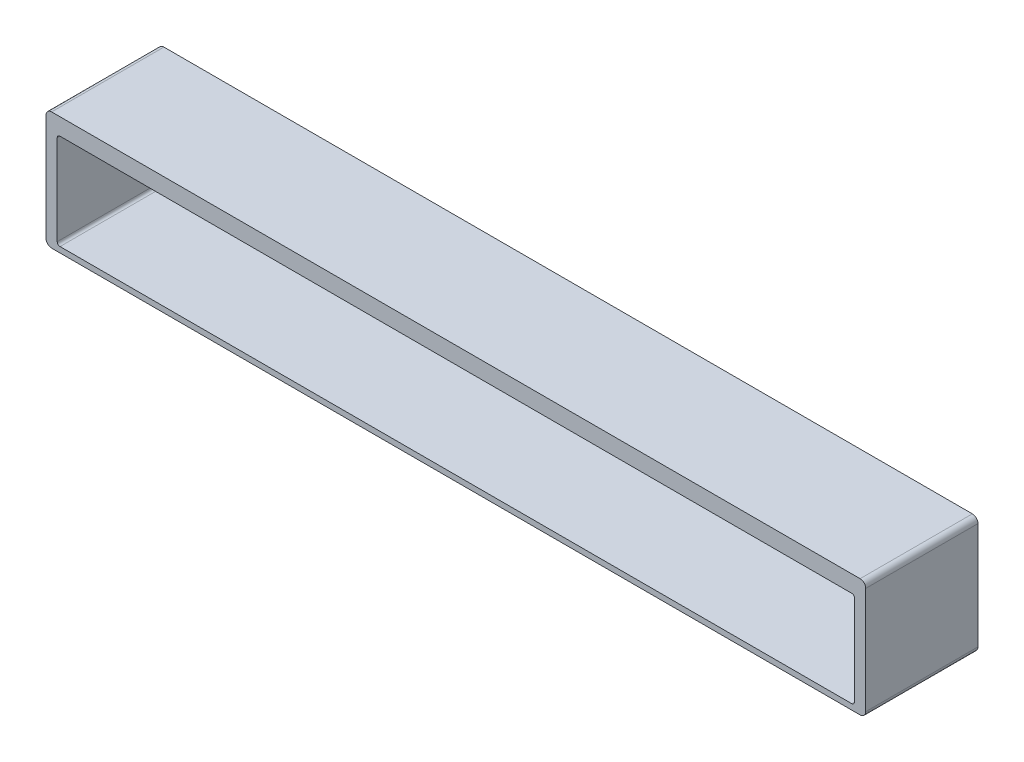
ISO-10303-21;
HEADER;
FILE_DESCRIPTION(('STEP AP214'),'2;1');
FILE_NAME('part.step','',(''),(''),'','','');
FILE_SCHEMA(('AUTOMOTIVE_DESIGN { 1 0 10303 214 1 1 1 1 }'));
ENDSEC;
DATA;
#1=APPLICATION_CONTEXT('core data for automotive mechanical design processes');
#2=APPLICATION_PROTOCOL_DEFINITION('international standard','automotive_design',2000,#1);
#3=PRODUCT_CONTEXT('',#1,'mechanical');
#4=PRODUCT('Part','Part','',(#3));
#5=PRODUCT_RELATED_PRODUCT_CATEGORY('part','',(#4));
#6=PRODUCT_DEFINITION_FORMATION('','',#4);
#7=PRODUCT_DEFINITION_CONTEXT('part definition',#1,'design');
#8=PRODUCT_DEFINITION('design','',#6,#7);
#9=PRODUCT_DEFINITION_SHAPE('','',#8);
#10=(LENGTH_UNIT() NAMED_UNIT(*) SI_UNIT(.MILLI.,.METRE.));
#11=(NAMED_UNIT(*) PLANE_ANGLE_UNIT() SI_UNIT($,.RADIAN.));
#12=(NAMED_UNIT(*) SI_UNIT($,.STERADIAN.) SOLID_ANGLE_UNIT());
#13=UNCERTAINTY_MEASURE_WITH_UNIT(LENGTH_MEASURE(1.E-05),#10,'distance_accuracy_value','');
#14=(GEOMETRIC_REPRESENTATION_CONTEXT(3) GLOBAL_UNCERTAINTY_ASSIGNED_CONTEXT((#13)) GLOBAL_UNIT_ASSIGNED_CONTEXT((#10,
#11,#12)) REPRESENTATION_CONTEXT('',''));
#15=CARTESIAN_POINT('',(0.,0.,0.));
#16=DIRECTION('',(0.,0.,1.));
#17=DIRECTION('',(1.,0.,0.));
#18=AXIS2_PLACEMENT_3D('',#15,#16,#17);
#19=CARTESIAN_POINT('',(-88.2099650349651,-6.1076923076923,-166.016788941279));
#20=DIRECTION('',(0.,1.,0.));
#21=DIRECTION('',(0.,0.,1.));
#22=AXIS2_PLACEMENT_3D('',#19,#20,#21);
#23=PLANE('',#22);
#24=DIRECTION('',(-1.,0.,0.));
#25=VECTOR('',#24,1.);
#26=CARTESIAN_POINT('',(-88.2099650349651,-6.1076923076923,-90.));
#27=LINE('',#26,#25);
#28=CARTESIAN_POINT('',(-18.7099650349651,-6.1076923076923,-90.));
#29=VERTEX_POINT('',#28);
#30=CARTESIAN_POINT('',(-90.7099650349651,-6.1076923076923,-90.));
#31=VERTEX_POINT('',#30);
#32=EDGE_CURVE('E260',#29,#31,#27,.T.);
#33=ORIENTED_EDGE('',*,*,#32,.F.);
#34=DIRECTION('',(0.,0.,-1.));
#35=VECTOR('',#34,1.);
#36=CARTESIAN_POINT('',(-18.7099650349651,-6.1076923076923,-166.016788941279));
#37=LINE('',#36,#35);
#38=CARTESIAN_POINT('',(-18.7099650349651,-6.1076923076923,-100.));
#39=VERTEX_POINT('',#38);
#40=EDGE_CURVE('E246',#29,#39,#37,.T.);
#41=ORIENTED_EDGE('',*,*,#40,.T.);
#42=DIRECTION('',(1.,0.,0.));
#43=VECTOR('',#42,1.);
#44=CARTESIAN_POINT('',(-98.7668120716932,-6.1076923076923,-100.));
#45=LINE('',#44,#43);
#46=CARTESIAN_POINT('',(-90.7099650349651,-6.1076923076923,-100.));
#47=VERTEX_POINT('',#46);
#48=EDGE_CURVE('E190',#47,#39,#45,.T.);
#49=ORIENTED_EDGE('',*,*,#48,.F.);
#50=DIRECTION('',(0.,0.,1.));
#51=VECTOR('',#50,1.);
#52=CARTESIAN_POINT('',(-90.7099650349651,-6.1076923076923,-166.016788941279));
#53=LINE('',#52,#51);
#54=EDGE_CURVE('E243',#47,#31,#53,.T.);
#55=ORIENTED_EDGE('',*,*,#54,.T.);
#56=EDGE_LOOP('',(#33,#41,#49,#55));
#57=FACE_BOUND('',#56,.T.);
#58=ADVANCED_FACE('F30',(#57),#23,.T.);
#59=CARTESIAN_POINT('',(-98.7668120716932,-16.6170699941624,-99.));
#60=DIRECTION('',(0.,-1.,0.));
#61=DIRECTION('',(0.,0.,-1.));
#62=AXIS2_PLACEMENT_3D('',#59,#60,#61);
#63=PLANE('',#62);
#64=DIRECTION('',(1.,0.,0.));
#65=VECTOR('',#64,1.);
#66=CARTESIAN_POINT('',(-98.7668120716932,-16.6170699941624,-90.));
#67=LINE('',#66,#65);
#68=CARTESIAN_POINT('',(-90.7099650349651,-16.6170699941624,-90.));
#69=VERTEX_POINT('',#68);
#70=CARTESIAN_POINT('',(-18.7099650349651,-16.6170699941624,-90.));
#71=VERTEX_POINT('',#70);
#72=EDGE_CURVE('E265',#69,#71,#67,.T.);
#73=ORIENTED_EDGE('',*,*,#72,.F.);
#74=DIRECTION('',(0.,0.,1.));
#75=VECTOR('',#74,1.);
#76=CARTESIAN_POINT('',(-90.7099650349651,-16.6170699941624,-99.));
#77=LINE('',#76,#75);
#78=CARTESIAN_POINT('',(-90.7099650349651,-16.6170699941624,-100.));
#79=VERTEX_POINT('',#78);
#80=EDGE_CURVE('E235',#69,#79,#77,.F.);
#81=ORIENTED_EDGE('',*,*,#80,.T.);
#82=DIRECTION('',(1.,0.,0.));
#83=VECTOR('',#82,1.);
#84=CARTESIAN_POINT('',(-98.7668120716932,-16.6170699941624,-100.));
#85=LINE('',#84,#83);
#86=CARTESIAN_POINT('',(-18.7099650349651,-16.6170699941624,-100.));
#87=VERTEX_POINT('',#86);
#88=EDGE_CURVE('E181',#79,#87,#85,.T.);
#89=ORIENTED_EDGE('',*,*,#88,.T.);
#90=DIRECTION('',(0.,0.,-1.));
#91=VECTOR('',#90,1.);
#92=CARTESIAN_POINT('',(-18.7099650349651,-16.6170699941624,-99.));
#93=LINE('',#92,#91);
#94=EDGE_CURVE('E233',#87,#71,#93,.F.);
#95=ORIENTED_EDGE('',*,*,#94,.T.);
#96=EDGE_LOOP('',(#73,#81,#89,#95));
#97=FACE_BOUND('',#96,.T.);
#98=ADVANCED_FACE('F297',(#97),#63,.T.);
#99=CARTESIAN_POINT('',(-98.7668120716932,-6.1076923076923,-100.));
#100=DIRECTION('',(0.,0.,-1.));
#101=DIRECTION('',(-1.,0.,0.));
#102=AXIS2_PLACEMENT_3D('',#99,#100,#101);
#103=PLANE('',#102);
#104=ORIENTED_EDGE('',*,*,#88,.F.);
#105=CARTESIAN_POINT('',(-90.7099650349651,-16.1170699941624,-100.));
#106=DIRECTION('',(0.,0.,-1.));
#107=DIRECTION('',(-1.,0.,0.));
#108=AXIS2_PLACEMENT_3D('',#105,#106,#107);
#109=CIRCLE('',#108,0.5);
#110=CARTESIAN_POINT('',(-91.2099650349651,-16.1170699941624,-100.));
#111=VERTEX_POINT('',#110);
#112=EDGE_CURVE('E241',#79,#111,#109,.T.);
#113=ORIENTED_EDGE('',*,*,#112,.T.);
#114=DIRECTION('',(0.,1.,0.));
#115=VECTOR('',#114,1.);
#116=CARTESIAN_POINT('',(-91.2099650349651,-104.00394301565,-100.));
#117=LINE('',#116,#115);
#118=CARTESIAN_POINT('',(-91.2099650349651,-6.6076923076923,-100.));
#119=VERTEX_POINT('',#118);
#120=EDGE_CURVE('E188',#111,#119,#117,.T.);
#121=ORIENTED_EDGE('',*,*,#120,.T.);
#122=CARTESIAN_POINT('',(-90.7099650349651,-6.6076923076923,-100.));
#123=DIRECTION('',(0.,0.,-1.));
#124=DIRECTION('',(-1.,0.,0.));
#125=AXIS2_PLACEMENT_3D('',#122,#123,#124);
#126=CIRCLE('',#125,0.5);
#127=EDGE_CURVE('E238',#119,#47,#126,.T.);
#128=ORIENTED_EDGE('',*,*,#127,.T.);
#129=ORIENTED_EDGE('',*,*,#48,.T.);
#130=CARTESIAN_POINT('',(-18.7099650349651,-6.6076923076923,-100.));
#131=DIRECTION('',(0.,0.,-1.));
#132=DIRECTION('',(-1.,0.,0.));
#133=AXIS2_PLACEMENT_3D('',#130,#131,#132);
#134=CIRCLE('',#133,0.5);
#135=CARTESIAN_POINT('',(-18.2099650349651,-6.6076923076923,-100.));
#136=VERTEX_POINT('',#135);
#137=EDGE_CURVE('E45',#39,#136,#134,.T.);
#138=ORIENTED_EDGE('',*,*,#137,.T.);
#139=DIRECTION('',(0.,1.,0.));
#140=VECTOR('',#139,1.);
#141=CARTESIAN_POINT('',(-18.2099650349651,-104.00394301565,-100.));
#142=LINE('',#141,#140);
#143=CARTESIAN_POINT('',(-18.2099650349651,-16.1170699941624,-100.));
#144=VERTEX_POINT('',#143);
#145=EDGE_CURVE('E251',#144,#136,#142,.T.);
#146=ORIENTED_EDGE('',*,*,#145,.F.);
#147=CARTESIAN_POINT('',(-18.7099650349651,-16.1170699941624,-100.));
#148=DIRECTION('',(0.,0.,-1.));
#149=DIRECTION('',(-1.,0.,0.));
#150=AXIS2_PLACEMENT_3D('',#147,#148,#149);
#151=CIRCLE('',#150,0.5);
#152=EDGE_CURVE('E53',#144,#87,#151,.T.);
#153=ORIENTED_EDGE('',*,*,#152,.T.);
#154=EDGE_LOOP('',(#104,#113,#121,#128,#129,#138,#146,#153));
#155=FACE_BOUND('',#154,.T.);
#156=ADVANCED_FACE('F257',(#155),#103,.T.);
#157=CARTESIAN_POINT('',(-91.2099650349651,-104.00394301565,-12.6188488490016));
#158=DIRECTION('',(-1.,0.,0.));
#159=DIRECTION('',(0.,0.,1.));
#160=AXIS2_PLACEMENT_3D('',#157,#158,#159);
#161=PLANE('',#160);
#162=ORIENTED_EDGE('',*,*,#120,.F.);
#163=DIRECTION('',(0.,0.,1.));
#164=VECTOR('',#163,1.);
#165=CARTESIAN_POINT('',(-91.2099650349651,-16.1170699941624,-12.6188488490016));
#166=LINE('',#165,#164);
#167=CARTESIAN_POINT('',(-91.2099650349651,-16.1170699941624,-90.));
#168=VERTEX_POINT('',#167);
#169=EDGE_CURVE('E222',#111,#168,#166,.T.);
#170=ORIENTED_EDGE('',*,*,#169,.T.);
#171=DIRECTION('',(0.,-1.,0.));
#172=VECTOR('',#171,1.);
#173=CARTESIAN_POINT('',(-91.2099650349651,-40.6709312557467,-90.));
#174=LINE('',#173,#172);
#175=CARTESIAN_POINT('',(-91.2099650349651,-6.6076923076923,-90.));
#176=VERTEX_POINT('',#175);
#177=EDGE_CURVE('E274',#176,#168,#174,.T.);
#178=ORIENTED_EDGE('',*,*,#177,.F.);
#179=DIRECTION('',(0.,0.,1.));
#180=VECTOR('',#179,1.);
#181=CARTESIAN_POINT('',(-91.2099650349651,-6.6076923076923,-12.6188488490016));
#182=LINE('',#181,#180);
#183=EDGE_CURVE('E220',#176,#119,#182,.F.);
#184=ORIENTED_EDGE('',*,*,#183,.T.);
#185=EDGE_LOOP('',(#162,#170,#178,#184));
#186=FACE_BOUND('',#185,.T.);
#187=ADVANCED_FACE('F283',(#186),#161,.T.);
#188=CARTESIAN_POINT('',(-18.2099650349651,-104.00394301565,-12.6188488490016));
#189=DIRECTION('',(1.,0.,0.));
#190=DIRECTION('',(0.,0.,-1.));
#191=AXIS2_PLACEMENT_3D('',#188,#189,#190);
#192=PLANE('',#191);
#193=ORIENTED_EDGE('',*,*,#145,.T.);
#194=DIRECTION('',(0.,0.,-1.));
#195=VECTOR('',#194,1.);
#196=CARTESIAN_POINT('',(-18.2099650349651,-6.6076923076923,-12.6188488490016));
#197=LINE('',#196,#195);
#198=CARTESIAN_POINT('',(-18.2099650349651,-6.6076923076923,-90.));
#199=VERTEX_POINT('',#198);
#200=EDGE_CURVE('E11',#136,#199,#197,.F.);
#201=ORIENTED_EDGE('',*,*,#200,.T.);
#202=DIRECTION('',(0.,-1.,0.));
#203=VECTOR('',#202,1.);
#204=CARTESIAN_POINT('',(-18.2099650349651,-40.6709312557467,-90.));
#205=LINE('',#204,#203);
#206=CARTESIAN_POINT('',(-18.2099650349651,-16.1170699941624,-90.));
#207=VERTEX_POINT('',#206);
#208=EDGE_CURVE('E254',#199,#207,#205,.T.);
#209=ORIENTED_EDGE('',*,*,#208,.T.);
#210=DIRECTION('',(0.,0.,-1.));
#211=VECTOR('',#210,1.);
#212=CARTESIAN_POINT('',(-18.2099650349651,-16.1170699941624,-12.6188488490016));
#213=LINE('',#212,#211);
#214=EDGE_CURVE('E38',#207,#144,#213,.T.);
#215=ORIENTED_EDGE('',*,*,#214,.T.);
#216=EDGE_LOOP('',(#193,#201,#209,#215));
#217=FACE_BOUND('',#216,.T.);
#218=ADVANCED_FACE('F250',(#217),#192,.T.);
#219=CARTESIAN_POINT('',(-18.2099650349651,-40.6709312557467,-90.));
#220=DIRECTION('',(0.,0.,-1.));
#221=DIRECTION('',(-1.,0.,0.));
#222=AXIS2_PLACEMENT_3D('',#219,#220,#221);
#223=PLANE('',#222);
#224=ORIENTED_EDGE('',*,*,#177,.T.);
#225=CARTESIAN_POINT('',(-90.7099650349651,-16.1170699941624,-90.));
#226=DIRECTION('',(0.,0.,-1.));
#227=DIRECTION('',(-1.,0.,0.));
#228=AXIS2_PLACEMENT_3D('',#225,#226,#227);
#229=CIRCLE('',#228,0.5);
#230=EDGE_CURVE('E231',#168,#69,#229,.F.);
#231=ORIENTED_EDGE('',*,*,#230,.T.);
#232=ORIENTED_EDGE('',*,*,#72,.T.);
#233=CARTESIAN_POINT('',(-18.7099650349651,-16.1170699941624,-90.));
#234=DIRECTION('',(0.,0.,-1.));
#235=DIRECTION('',(-1.,0.,0.));
#236=AXIS2_PLACEMENT_3D('',#233,#234,#235);
#237=CIRCLE('',#236,0.5);
#238=EDGE_CURVE('E225',#71,#207,#237,.F.);
#239=ORIENTED_EDGE('',*,*,#238,.T.);
#240=ORIENTED_EDGE('',*,*,#208,.F.);
#241=CARTESIAN_POINT('',(-18.7099650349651,-6.6076923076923,-90.));
#242=DIRECTION('',(0.,0.,-1.));
#243=DIRECTION('',(-1.,0.,0.));
#244=AXIS2_PLACEMENT_3D('',#241,#242,#243);
#245=CIRCLE('',#244,0.5);
#246=EDGE_CURVE('E229',#199,#29,#245,.F.);
#247=ORIENTED_EDGE('',*,*,#246,.T.);
#248=ORIENTED_EDGE('',*,*,#32,.T.);
#249=CARTESIAN_POINT('',(-90.7099650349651,-6.6076923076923,-90.));
#250=DIRECTION('',(0.,0.,-1.));
#251=DIRECTION('',(-1.,0.,0.));
#252=AXIS2_PLACEMENT_3D('',#249,#250,#251);
#253=CIRCLE('',#252,0.5);
#254=EDGE_CURVE('E227',#31,#176,#253,.F.);
#255=ORIENTED_EDGE('',*,*,#254,.T.);
#256=EDGE_LOOP('',(#224,#231,#232,#239,#240,#247,#248,#255));
#257=FACE_BOUND('',#256,.T.);
#258=DIRECTION('',(0.,1.,0.));
#259=VECTOR('',#258,1.);
#260=CARTESIAN_POINT('',(-90.2099650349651,-104.00394301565,-90.));
#261=LINE('',#260,#259);
#262=CARTESIAN_POINT('',(-90.2099650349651,-15.8670699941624,-90.));
#263=VERTEX_POINT('',#262);
#264=CARTESIAN_POINT('',(-90.2099650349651,-7.8576923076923,-90.));
#265=VERTEX_POINT('',#264);
#266=EDGE_CURVE('E271',#263,#265,#261,.T.);
#267=ORIENTED_EDGE('',*,*,#266,.T.);
#268=CARTESIAN_POINT('',(-89.9599650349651,-7.8576923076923,-90.));
#269=DIRECTION('',(0.,0.,-1.));
#270=DIRECTION('',(-1.,0.,0.));
#271=AXIS2_PLACEMENT_3D('',#268,#269,#270);
#272=CIRCLE('',#271,0.25);
#273=CARTESIAN_POINT('',(-89.9599650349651,-7.60769230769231,-90.));
#274=VERTEX_POINT('',#273);
#275=EDGE_CURVE('E216',#265,#274,#272,.T.);
#276=ORIENTED_EDGE('',*,*,#275,.T.);
#277=DIRECTION('',(1.,0.,0.));
#278=VECTOR('',#277,1.);
#279=CARTESIAN_POINT('',(-88.2099650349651,-7.60769230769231,-90.));
#280=LINE('',#279,#278);
#281=CARTESIAN_POINT('',(-19.4599650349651,-7.60769230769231,-90.));
#282=VERTEX_POINT('',#281);
#283=EDGE_CURVE('E268',#274,#282,#280,.T.);
#284=ORIENTED_EDGE('',*,*,#283,.T.);
#285=CARTESIAN_POINT('',(-19.4599650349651,-7.8576923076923,-90.));
#286=DIRECTION('',(0.,0.,-1.));
#287=DIRECTION('',(-1.,0.,0.));
#288=AXIS2_PLACEMENT_3D('',#285,#286,#287);
#289=CIRCLE('',#288,0.25);
#290=CARTESIAN_POINT('',(-19.2099650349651,-7.8576923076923,-90.));
#291=VERTEX_POINT('',#290);
#292=EDGE_CURVE('E218',#282,#291,#289,.T.);
#293=ORIENTED_EDGE('',*,*,#292,.T.);
#294=DIRECTION('',(0.,-1.,0.));
#295=VECTOR('',#294,1.);
#296=CARTESIAN_POINT('',(-19.2099650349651,-104.00394301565,-90.));
#297=LINE('',#296,#295);
#298=CARTESIAN_POINT('',(-19.2099650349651,-15.8670699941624,-90.));
#299=VERTEX_POINT('',#298);
#300=EDGE_CURVE('E151',#291,#299,#297,.T.);
#301=ORIENTED_EDGE('',*,*,#300,.T.);
#302=CARTESIAN_POINT('',(-19.4599650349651,-15.8670699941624,-90.));
#303=DIRECTION('',(0.,0.,-1.));
#304=DIRECTION('',(-1.,0.,0.));
#305=AXIS2_PLACEMENT_3D('',#302,#303,#304);
#306=CIRCLE('',#305,0.25);
#307=CARTESIAN_POINT('',(-19.4599650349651,-16.1170699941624,-90.));
#308=VERTEX_POINT('',#307);
#309=EDGE_CURVE('E145',#299,#308,#306,.T.);
#310=ORIENTED_EDGE('',*,*,#309,.T.);
#311=DIRECTION('',(-1.,0.,0.));
#312=VECTOR('',#311,1.);
#313=CARTESIAN_POINT('',(-18.2099650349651,-16.1170699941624,-90.));
#314=LINE('',#313,#312);
#315=CARTESIAN_POINT('',(-89.9599650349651,-16.1170699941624,-90.));
#316=VERTEX_POINT('',#315);
#317=EDGE_CURVE('E149',#308,#316,#314,.T.);
#318=ORIENTED_EDGE('',*,*,#317,.T.);
#319=CARTESIAN_POINT('',(-89.9599650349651,-15.8670699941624,-90.));
#320=DIRECTION('',(0.,0.,-1.));
#321=DIRECTION('',(-1.,0.,0.));
#322=AXIS2_PLACEMENT_3D('',#319,#320,#321);
#323=CIRCLE('',#322,0.25);
#324=EDGE_CURVE('E155',#316,#263,#323,.T.);
#325=ORIENTED_EDGE('',*,*,#324,.T.);
#326=EDGE_LOOP('',(#267,#276,#284,#293,#301,#310,#318,#325));
#327=FACE_BOUND('',#326,.T.);
#328=ADVANCED_FACE('F148',(#257,#327),#223,.F.);
#329=CARTESIAN_POINT('',(-98.7668120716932,-6.1076923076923,-99.));
#330=DIRECTION('',(0.,0.,1.));
#331=DIRECTION('',(1.,0.,0.));
#332=AXIS2_PLACEMENT_3D('',#329,#330,#331);
#333=PLANE('',#332);
#334=DIRECTION('',(-1.,0.,0.));
#335=VECTOR('',#334,1.);
#336=CARTESIAN_POINT('',(-98.7668120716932,-16.1170699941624,-99.));
#337=LINE('',#336,#335);
#338=CARTESIAN_POINT('',(-19.4599650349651,-16.1170699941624,-99.));
#339=VERTEX_POINT('',#338);
#340=CARTESIAN_POINT('',(-89.9599650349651,-16.1170699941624,-99.));
#341=VERTEX_POINT('',#340);
#342=EDGE_CURVE('E258',#339,#341,#337,.T.);
#343=ORIENTED_EDGE('',*,*,#342,.F.);
#344=CARTESIAN_POINT('',(-19.4599650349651,-15.8670699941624,-99.));
#345=DIRECTION('',(0.,0.,1.));
#346=DIRECTION('',(1.,0.,0.));
#347=AXIS2_PLACEMENT_3D('',#344,#345,#346);
#348=CIRCLE('',#347,0.25);
#349=CARTESIAN_POINT('',(-19.2099650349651,-15.8670699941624,-99.));
#350=VERTEX_POINT('',#349);
#351=EDGE_CURVE('E170',#339,#350,#348,.T.);
#352=ORIENTED_EDGE('',*,*,#351,.T.);
#353=DIRECTION('',(0.,-1.,0.));
#354=VECTOR('',#353,1.);
#355=CARTESIAN_POINT('',(-19.2099650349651,-5.37162433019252,-99.));
#356=LINE('',#355,#354);
#357=CARTESIAN_POINT('',(-19.2099650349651,-7.8576923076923,-99.));
#358=VERTEX_POINT('',#357);
#359=EDGE_CURVE('E177',#358,#350,#356,.T.);
#360=ORIENTED_EDGE('',*,*,#359,.F.);
#361=CARTESIAN_POINT('',(-19.4599650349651,-7.8576923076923,-99.));
#362=DIRECTION('',(0.,0.,1.));
#363=DIRECTION('',(1.,0.,0.));
#364=AXIS2_PLACEMENT_3D('',#361,#362,#363);
#365=CIRCLE('',#364,0.25);
#366=CARTESIAN_POINT('',(-19.4599650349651,-7.60769230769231,-99.));
#367=VERTEX_POINT('',#366);
#368=EDGE_CURVE('E171',#358,#367,#365,.T.);
#369=ORIENTED_EDGE('',*,*,#368,.T.);
#370=DIRECTION('',(1.,0.,0.));
#371=VECTOR('',#370,1.);
#372=CARTESIAN_POINT('',(-88.2099650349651,-7.60769230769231,-99.));
#373=LINE('',#372,#371);
#374=CARTESIAN_POINT('',(-89.9599650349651,-7.60769230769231,-99.));
#375=VERTEX_POINT('',#374);
#376=EDGE_CURVE('E167',#375,#367,#373,.T.);
#377=ORIENTED_EDGE('',*,*,#376,.F.);
#378=CARTESIAN_POINT('',(-89.9599650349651,-7.8576923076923,-99.));
#379=DIRECTION('',(0.,0.,1.));
#380=DIRECTION('',(1.,0.,0.));
#381=AXIS2_PLACEMENT_3D('',#378,#379,#380);
#382=CIRCLE('',#381,0.25);
#383=CARTESIAN_POINT('',(-90.2099650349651,-7.8576923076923,-99.));
#384=VERTEX_POINT('',#383);
#385=EDGE_CURVE('E173',#375,#384,#382,.T.);
#386=ORIENTED_EDGE('',*,*,#385,.T.);
#387=DIRECTION('',(0.,-1.,0.));
#388=VECTOR('',#387,1.);
#389=CARTESIAN_POINT('',(-90.2099650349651,-5.37162433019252,-99.));
#390=LINE('',#389,#388);
#391=CARTESIAN_POINT('',(-90.2099650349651,-15.8670699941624,-99.));
#392=VERTEX_POINT('',#391);
#393=EDGE_CURVE('E182',#384,#392,#390,.T.);
#394=ORIENTED_EDGE('',*,*,#393,.T.);
#395=CARTESIAN_POINT('',(-89.9599650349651,-15.8670699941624,-99.));
#396=DIRECTION('',(0.,0.,1.));
#397=DIRECTION('',(1.,0.,0.));
#398=AXIS2_PLACEMENT_3D('',#395,#396,#397);
#399=CIRCLE('',#398,0.25);
#400=EDGE_CURVE('E199',#392,#341,#399,.T.);
#401=ORIENTED_EDGE('',*,*,#400,.T.);
#402=EDGE_LOOP('',(#343,#352,#360,#369,#377,#386,#394,#401));
#403=FACE_BOUND('',#402,.T.);
#404=ADVANCED_FACE('F342',(#403),#333,.T.);
#405=CARTESIAN_POINT('',(-18.2099650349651,-16.1170699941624,-173.001712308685));
#406=DIRECTION('',(0.,1.,0.));
#407=DIRECTION('',(-1.,0.,0.));
#408=AXIS2_PLACEMENT_3D('',#405,#406,#407);
#409=PLANE('',#408);
#410=ORIENTED_EDGE('',*,*,#317,.F.);
#411=DIRECTION('',(0.,0.,-1.));
#412=VECTOR('',#411,1.);
#413=CARTESIAN_POINT('',(-19.4599650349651,-16.1170699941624,-99.));
#414=LINE('',#413,#412);
#415=EDGE_CURVE('E163',#308,#339,#414,.T.);
#416=ORIENTED_EDGE('',*,*,#415,.T.);
#417=ORIENTED_EDGE('',*,*,#342,.T.);
#418=DIRECTION('',(0.,0.,1.));
#419=VECTOR('',#418,1.);
#420=CARTESIAN_POINT('',(-89.9599650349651,-16.1170699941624,-90.));
#421=LINE('',#420,#419);
#422=EDGE_CURVE('E166',#341,#316,#421,.T.);
#423=ORIENTED_EDGE('',*,*,#422,.T.);
#424=EDGE_LOOP('',(#410,#416,#417,#423));
#425=FACE_BOUND('',#424,.T.);
#426=ADVANCED_FACE('F161',(#425),#409,.T.);
#427=CARTESIAN_POINT('',(-19.2099650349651,-104.00394301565,-12.6188488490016));
#428=DIRECTION('',(-1.,0.,0.));
#429=DIRECTION('',(0.,0.,1.));
#430=AXIS2_PLACEMENT_3D('',#427,#428,#429);
#431=PLANE('',#430);
#432=ORIENTED_EDGE('',*,*,#359,.T.);
#433=DIRECTION('',(0.,0.,-1.));
#434=VECTOR('',#433,1.);
#435=CARTESIAN_POINT('',(-19.2099650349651,-15.8670699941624,-90.));
#436=LINE('',#435,#434);
#437=EDGE_CURVE('E205',#350,#299,#436,.F.);
#438=ORIENTED_EDGE('',*,*,#437,.T.);
#439=ORIENTED_EDGE('',*,*,#300,.F.);
#440=DIRECTION('',(0.,0.,-1.));
#441=VECTOR('',#440,1.);
#442=CARTESIAN_POINT('',(-19.2099650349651,-7.8576923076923,-99.));
#443=LINE('',#442,#441);
#444=EDGE_CURVE('E202',#291,#358,#443,.T.);
#445=ORIENTED_EDGE('',*,*,#444,.T.);
#446=EDGE_LOOP('',(#432,#438,#439,#445));
#447=FACE_BOUND('',#446,.T.);
#448=ADVANCED_FACE('F350',(#447),#431,.T.);
#449=CARTESIAN_POINT('',(-90.2099650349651,-104.00394301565,-12.6188488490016));
#450=DIRECTION('',(1.,0.,0.));
#451=DIRECTION('',(0.,0.,-1.));
#452=AXIS2_PLACEMENT_3D('',#449,#450,#451);
#453=PLANE('',#452);
#454=ORIENTED_EDGE('',*,*,#266,.F.);
#455=DIRECTION('',(0.,0.,1.));
#456=VECTOR('',#455,1.);
#457=CARTESIAN_POINT('',(-90.2099650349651,-15.8670699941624,-99.));
#458=LINE('',#457,#456);
#459=EDGE_CURVE('E210',#263,#392,#458,.F.);
#460=ORIENTED_EDGE('',*,*,#459,.T.);
#461=ORIENTED_EDGE('',*,*,#393,.F.);
#462=DIRECTION('',(0.,0.,1.));
#463=VECTOR('',#462,1.);
#464=CARTESIAN_POINT('',(-90.2099650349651,-7.8576923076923,-90.));
#465=LINE('',#464,#463);
#466=EDGE_CURVE('E207',#384,#265,#465,.T.);
#467=ORIENTED_EDGE('',*,*,#466,.T.);
#468=EDGE_LOOP('',(#454,#460,#461,#467));
#469=FACE_BOUND('',#468,.T.);
#470=ADVANCED_FACE('F324',(#469),#453,.T.);
#471=CARTESIAN_POINT('',(-88.2099650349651,-7.60769230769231,-166.016788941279));
#472=DIRECTION('',(0.,-1.,0.));
#473=DIRECTION('',(0.,0.,-1.));
#474=AXIS2_PLACEMENT_3D('',#471,#472,#473);
#475=PLANE('',#474);
#476=ORIENTED_EDGE('',*,*,#283,.F.);
#477=DIRECTION('',(0.,0.,1.));
#478=VECTOR('',#477,1.);
#479=CARTESIAN_POINT('',(-89.9599650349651,-7.60769230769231,-99.));
#480=LINE('',#479,#478);
#481=EDGE_CURVE('E156',#274,#375,#480,.F.);
#482=ORIENTED_EDGE('',*,*,#481,.T.);
#483=ORIENTED_EDGE('',*,*,#376,.T.);
#484=DIRECTION('',(0.,0.,-1.));
#485=VECTOR('',#484,1.);
#486=CARTESIAN_POINT('',(-19.4599650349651,-7.60769230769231,-90.));
#487=LINE('',#486,#485);
#488=EDGE_CURVE('E212',#367,#282,#487,.F.);
#489=ORIENTED_EDGE('',*,*,#488,.T.);
#490=EDGE_LOOP('',(#476,#482,#483,#489));
#491=FACE_BOUND('',#490,.T.);
#492=ADVANCED_FACE('F321',(#491),#475,.T.);
#493=CARTESIAN_POINT('',(-19.4599650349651,-15.8670699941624,-173.001712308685));
#494=DIRECTION('',(0.,0.,1.));
#495=DIRECTION('',(1.,0.,0.));
#496=AXIS2_PLACEMENT_3D('',#493,#494,#495);
#497=CYLINDRICAL_SURFACE('',#496,0.25);
#498=ORIENTED_EDGE('',*,*,#309,.F.);
#499=ORIENTED_EDGE('',*,*,#437,.F.);
#500=ORIENTED_EDGE('',*,*,#351,.F.);
#501=ORIENTED_EDGE('',*,*,#415,.F.);
#502=EDGE_LOOP('',(#498,#499,#500,#501));
#503=FACE_BOUND('',#502,.T.);
#504=ADVANCED_FACE('F169',(#503),#497,.F.);
#505=CARTESIAN_POINT('',(-89.9599650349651,-15.8670699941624,-173.001712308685));
#506=DIRECTION('',(0.,0.,-1.));
#507=DIRECTION('',(-1.,0.,0.));
#508=AXIS2_PLACEMENT_3D('',#505,#506,#507);
#509=CYLINDRICAL_SURFACE('',#508,0.25);
#510=ORIENTED_EDGE('',*,*,#400,.F.);
#511=ORIENTED_EDGE('',*,*,#459,.F.);
#512=ORIENTED_EDGE('',*,*,#324,.F.);
#513=ORIENTED_EDGE('',*,*,#422,.F.);
#514=EDGE_LOOP('',(#510,#511,#512,#513));
#515=FACE_BOUND('',#514,.T.);
#516=ADVANCED_FACE('F328',(#515),#509,.F.);
#517=CARTESIAN_POINT('',(-89.9599650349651,-7.8576923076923,-12.6188488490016));
#518=DIRECTION('',(0.,0.,-1.));
#519=DIRECTION('',(-1.,0.,0.));
#520=AXIS2_PLACEMENT_3D('',#517,#518,#519);
#521=CYLINDRICAL_SURFACE('',#520,0.25);
#522=ORIENTED_EDGE('',*,*,#385,.F.);
#523=ORIENTED_EDGE('',*,*,#481,.F.);
#524=ORIENTED_EDGE('',*,*,#275,.F.);
#525=ORIENTED_EDGE('',*,*,#466,.F.);
#526=EDGE_LOOP('',(#522,#523,#524,#525));
#527=FACE_BOUND('',#526,.T.);
#528=ADVANCED_FACE('F310',(#527),#521,.F.);
#529=CARTESIAN_POINT('',(-19.4599650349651,-7.8576923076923,-12.6188488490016));
#530=DIRECTION('',(0.,0.,1.));
#531=DIRECTION('',(1.,0.,0.));
#532=AXIS2_PLACEMENT_3D('',#529,#530,#531);
#533=CYLINDRICAL_SURFACE('',#532,0.25);
#534=ORIENTED_EDGE('',*,*,#292,.F.);
#535=ORIENTED_EDGE('',*,*,#488,.F.);
#536=ORIENTED_EDGE('',*,*,#368,.F.);
#537=ORIENTED_EDGE('',*,*,#444,.F.);
#538=EDGE_LOOP('',(#534,#535,#536,#537));
#539=FACE_BOUND('',#538,.T.);
#540=ADVANCED_FACE('F303',(#539),#533,.F.);
#541=CARTESIAN_POINT('',(-90.7099650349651,-16.1170699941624,-12.6188488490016));
#542=DIRECTION('',(0.,0.,1.));
#543=DIRECTION('',(1.,0.,0.));
#544=AXIS2_PLACEMENT_3D('',#541,#542,#543);
#545=CYLINDRICAL_SURFACE('',#544,0.5);
#546=ORIENTED_EDGE('',*,*,#112,.F.);
#547=ORIENTED_EDGE('',*,*,#80,.F.);
#548=ORIENTED_EDGE('',*,*,#230,.F.);
#549=ORIENTED_EDGE('',*,*,#169,.F.);
#550=EDGE_LOOP('',(#546,#547,#548,#549));
#551=FACE_BOUND('',#550,.T.);
#552=ADVANCED_FACE('F301',(#551),#545,.T.);
#553=CARTESIAN_POINT('',(-18.7099650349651,-6.6076923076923,-166.016788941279));
#554=DIRECTION('',(0.,0.,-1.));
#555=DIRECTION('',(-1.,0.,0.));
#556=AXIS2_PLACEMENT_3D('',#553,#554,#555);
#557=CYLINDRICAL_SURFACE('',#556,0.5);
#558=ORIENTED_EDGE('',*,*,#246,.F.);
#559=ORIENTED_EDGE('',*,*,#200,.F.);
#560=ORIENTED_EDGE('',*,*,#137,.F.);
#561=ORIENTED_EDGE('',*,*,#40,.F.);
#562=EDGE_LOOP('',(#558,#559,#560,#561));
#563=FACE_BOUND('',#562,.T.);
#564=ADVANCED_FACE('F295',(#563),#557,.T.);
#565=CARTESIAN_POINT('',(-90.7099650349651,-6.6076923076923,-166.016788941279));
#566=DIRECTION('',(0.,0.,1.));
#567=DIRECTION('',(1.,0.,0.));
#568=AXIS2_PLACEMENT_3D('',#565,#566,#567);
#569=CYLINDRICAL_SURFACE('',#568,0.5);
#570=ORIENTED_EDGE('',*,*,#127,.F.);
#571=ORIENTED_EDGE('',*,*,#183,.F.);
#572=ORIENTED_EDGE('',*,*,#254,.F.);
#573=ORIENTED_EDGE('',*,*,#54,.F.);
#574=EDGE_LOOP('',(#570,#571,#572,#573));
#575=FACE_BOUND('',#574,.T.);
#576=ADVANCED_FACE('F287',(#575),#569,.T.);
#577=CARTESIAN_POINT('',(-18.7099650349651,-16.1170699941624,-12.6188488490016));
#578=DIRECTION('',(0.,0.,-1.));
#579=DIRECTION('',(-1.,0.,0.));
#580=AXIS2_PLACEMENT_3D('',#577,#578,#579);
#581=CYLINDRICAL_SURFACE('',#580,0.5);
#582=ORIENTED_EDGE('',*,*,#238,.F.);
#583=ORIENTED_EDGE('',*,*,#94,.F.);
#584=ORIENTED_EDGE('',*,*,#152,.F.);
#585=ORIENTED_EDGE('',*,*,#214,.F.);
#586=EDGE_LOOP('',(#582,#583,#584,#585));
#587=FACE_BOUND('',#586,.T.);
#588=ADVANCED_FACE('F32',(#587),#581,.T.);
#589=CLOSED_SHELL('',(#58,#98,#156,#187,#218,#328,#404,#426,#448,#470,#492,#504,#516,#528,#540,
#552,#564,#576,#588));
#590=MANIFOLD_SOLID_BREP('B2',#589);
#591=ADVANCED_BREP_SHAPE_REPRESENTATION('',(#18,#590),#14);
#592=SHAPE_DEFINITION_REPRESENTATION(#9,#591);
ENDSEC;
END-ISO-10303-21;
